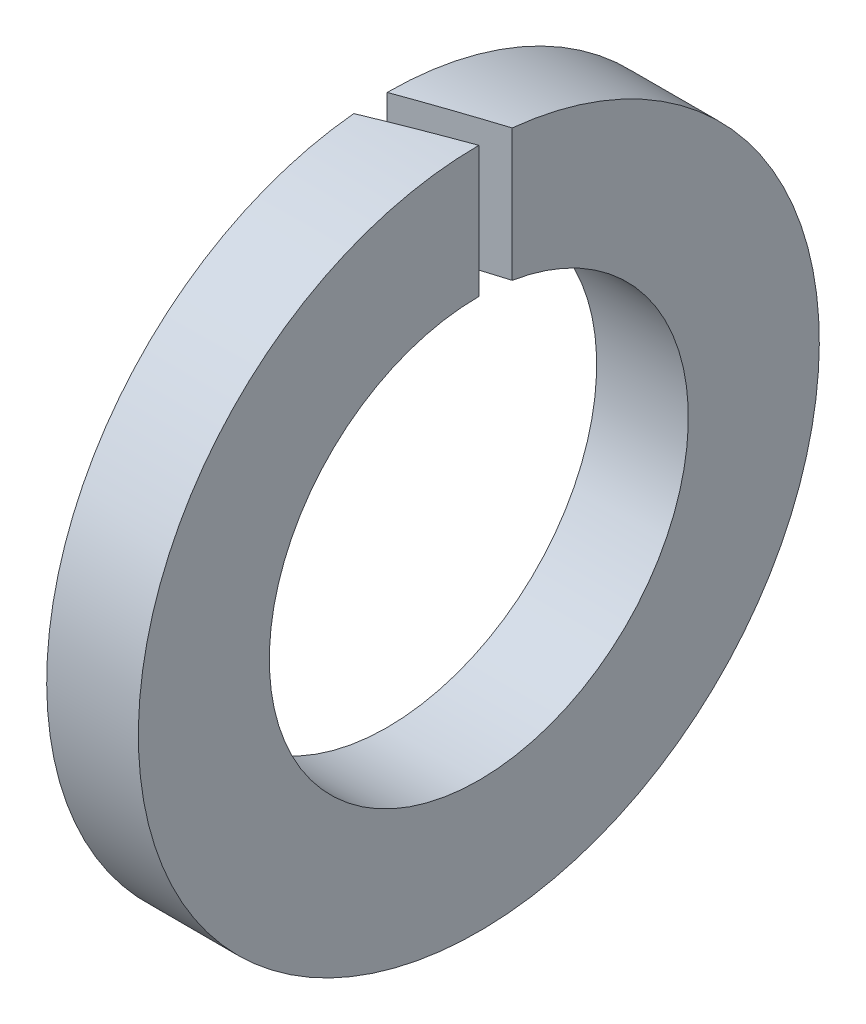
ISO-10303-21;
HEADER;
FILE_DESCRIPTION(('STEP AP214'),'2;1');
FILE_NAME('part.step','',(''),(''),'','','');
FILE_SCHEMA(('AUTOMOTIVE_DESIGN { 1 0 10303 214 1 1 1 1 }'));
ENDSEC;
DATA;
#1=APPLICATION_CONTEXT('core data for automotive mechanical design processes');
#2=APPLICATION_PROTOCOL_DEFINITION('international standard','automotive_design',2000,#1);
#3=PRODUCT_CONTEXT('',#1,'mechanical');
#4=PRODUCT('Part','Part','',(#3));
#5=PRODUCT_RELATED_PRODUCT_CATEGORY('part','',(#4));
#6=PRODUCT_DEFINITION_FORMATION('','',#4);
#7=PRODUCT_DEFINITION_CONTEXT('part definition',#1,'design');
#8=PRODUCT_DEFINITION('design','',#6,#7);
#9=PRODUCT_DEFINITION_SHAPE('','',#8);
#10=(LENGTH_UNIT() NAMED_UNIT(*) SI_UNIT(.MILLI.,.METRE.));
#11=(NAMED_UNIT(*) PLANE_ANGLE_UNIT() SI_UNIT($,.RADIAN.));
#12=(NAMED_UNIT(*) SI_UNIT($,.STERADIAN.) SOLID_ANGLE_UNIT());
#13=UNCERTAINTY_MEASURE_WITH_UNIT(LENGTH_MEASURE(1.E-05),#10,'distance_accuracy_value','');
#14=(GEOMETRIC_REPRESENTATION_CONTEXT(3) GLOBAL_UNCERTAINTY_ASSIGNED_CONTEXT((#13)) GLOBAL_UNIT_ASSIGNED_CONTEXT((#10,
#11,#12)) REPRESENTATION_CONTEXT('',''));
#15=CARTESIAN_POINT('',(0.,0.,0.));
#16=DIRECTION('',(0.,0.,1.));
#17=DIRECTION('',(1.,0.,0.));
#18=AXIS2_PLACEMENT_3D('',#15,#16,#17);
#19=CARTESIAN_POINT('',(0.,0.,-5.2));
#20=DIRECTION('',(1.,0.,0.));
#21=DIRECTION('',(0.,0.,-0.999999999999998));
#22=AXIS2_PLACEMENT_3D('',#19,#20,#21);
#23=PLANE('',#22);
#24=DIRECTION('',(0.,-0.999999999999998,0.));
#25=VECTOR('',#24,1.);
#26=CARTESIAN_POINT('',(0.,5.2,0.509558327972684));
#27=LINE('',#26,#25);
#28=CARTESIAN_POINT('',(0.,5.17497345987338,0.509558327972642));
#29=VERTEX_POINT('',#28);
#30=CARTESIAN_POINT('',(0.,3.1591692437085,0.509558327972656));
#31=VERTEX_POINT('',#30);
#32=EDGE_CURVE('E48',#29,#31,#27,.T.);
#33=ORIENTED_EDGE('',*,*,#32,.T.);
#34=CARTESIAN_POINT('',(0.,0.,0.));
#35=DIRECTION('',(-1.,0.,0.));
#36=DIRECTION('',(0.,0.,0.999999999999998));
#37=AXIS2_PLACEMENT_3D('',#34,#35,#36);
#38=CIRCLE('',#37,3.2);
#39=CARTESIAN_POINT('',(0.,3.19999999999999,0.));
#40=VERTEX_POINT('',#39);
#41=EDGE_CURVE('E82',#40,#31,#38,.T.);
#42=ORIENTED_EDGE('',*,*,#41,.F.);
#43=DIRECTION('',(0.,-0.999999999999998,0.));
#44=VECTOR('',#43,1.);
#45=CARTESIAN_POINT('',(0.,5.2,0.));
#46=LINE('',#45,#44);
#47=CARTESIAN_POINT('',(0.,5.2,0.));
#48=VERTEX_POINT('',#47);
#49=EDGE_CURVE('E91',#48,#40,#46,.T.);
#50=ORIENTED_EDGE('',*,*,#49,.F.);
#51=CARTESIAN_POINT('',(0.,0.,0.));
#52=DIRECTION('',(-1.,0.,0.));
#53=DIRECTION('',(0.,0.,0.999999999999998));
#54=AXIS2_PLACEMENT_3D('',#51,#52,#53);
#55=CIRCLE('',#54,5.2);
#56=EDGE_CURVE('E80',#48,#29,#55,.T.);
#57=ORIENTED_EDGE('',*,*,#56,.T.);
#58=EDGE_LOOP('',(#33,#42,#50,#57));
#59=FACE_BOUND('',#58,.T.);
#60=ADVANCED_FACE('F27',(#59),#23,.F.);
#61=CARTESIAN_POINT('',(0.,0.,0.));
#62=DIRECTION('',(-1.,0.,0.));
#63=DIRECTION('',(0.,0.,0.999999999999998));
#64=AXIS2_PLACEMENT_3D('',#61,#62,#63);
#65=CYLINDRICAL_SURFACE('',#64,3.2);
#66=CARTESIAN_POINT('',(1.4,0.,0.));
#67=DIRECTION('',(-0.34202014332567,0.,-0.939692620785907));
#68=DIRECTION('',(-0.939692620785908,0.,0.34202014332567));
#69=AXIS2_PLACEMENT_3D('',#66,#67,#68);
#70=ELLIPSE('',#69,9.35617408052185,3.2);
#71=CARTESIAN_POINT('',(1.4,3.19999999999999,0.));
#72=VERTEX_POINT('',#71);
#73=EDGE_CURVE('E84',#72,#31,#70,.F.);
#74=ORIENTED_EDGE('',*,*,#73,.F.);
#75=CARTESIAN_POINT('',(1.4,0.,0.));
#76=DIRECTION('',(-1.,0.,0.));
#77=DIRECTION('',(0.,0.,0.999999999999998));
#78=AXIS2_PLACEMENT_3D('',#75,#76,#77);
#79=CIRCLE('',#78,3.2);
#80=CARTESIAN_POINT('',(1.4,3.1591692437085,-0.509558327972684));
#81=VERTEX_POINT('',#80);
#82=EDGE_CURVE('E77',#81,#72,#79,.T.);
#83=ORIENTED_EDGE('',*,*,#82,.F.);
#84=CARTESIAN_POINT('',(0.,0.,0.));
#85=DIRECTION('',(0.34202014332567,0.,0.939692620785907));
#86=DIRECTION('',(-0.939692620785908,0.,0.34202014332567));
#87=AXIS2_PLACEMENT_3D('',#84,#85,#86);
#88=ELLIPSE('',#87,9.35617408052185,3.2);
#89=EDGE_CURVE('E99',#40,#81,#88,.F.);
#90=ORIENTED_EDGE('',*,*,#89,.F.);
#91=ORIENTED_EDGE('',*,*,#41,.T.);
#92=EDGE_LOOP('',(#74,#83,#90,#91));
#93=FACE_BOUND('',#92,.T.);
#94=ADVANCED_FACE('F101',(#93),#65,.F.);
#95=CARTESIAN_POINT('',(1.4,0.,-5.2));
#96=DIRECTION('',(-1.,0.,0.));
#97=DIRECTION('',(0.,0.,0.999999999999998));
#98=AXIS2_PLACEMENT_3D('',#95,#96,#97);
#99=PLANE('',#98);
#100=DIRECTION('',(0.,-0.999999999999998,0.));
#101=VECTOR('',#100,1.);
#102=CARTESIAN_POINT('',(1.4,5.2,0.));
#103=LINE('',#102,#101);
#104=CARTESIAN_POINT('',(1.4,5.2,0.));
#105=VERTEX_POINT('',#104);
#106=EDGE_CURVE('E65',#105,#72,#103,.T.);
#107=ORIENTED_EDGE('',*,*,#106,.F.);
#108=CARTESIAN_POINT('',(1.4,0.,0.));
#109=DIRECTION('',(-1.,0.,0.));
#110=DIRECTION('',(0.,0.,0.999999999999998));
#111=AXIS2_PLACEMENT_3D('',#108,#109,#110);
#112=CIRCLE('',#111,5.2);
#113=CARTESIAN_POINT('',(1.4,5.17497345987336,-0.509558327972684));
#114=VERTEX_POINT('',#113);
#115=EDGE_CURVE('E75',#114,#105,#112,.T.);
#116=ORIENTED_EDGE('',*,*,#115,.F.);
#117=DIRECTION('',(0.,-0.999999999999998,0.));
#118=VECTOR('',#117,1.);
#119=CARTESIAN_POINT('',(1.4,5.2,-0.509558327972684));
#120=LINE('',#119,#118);
#121=EDGE_CURVE('E41',#114,#81,#120,.T.);
#122=ORIENTED_EDGE('',*,*,#121,.T.);
#123=ORIENTED_EDGE('',*,*,#82,.T.);
#124=EDGE_LOOP('',(#107,#116,#122,#123));
#125=FACE_BOUND('',#124,.T.);
#126=ADVANCED_FACE('F74',(#125),#99,.F.);
#127=CARTESIAN_POINT('',(0.,0.,0.));
#128=DIRECTION('',(-1.,0.,0.));
#129=DIRECTION('',(0.,0.,0.999999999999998));
#130=AXIS2_PLACEMENT_3D('',#127,#128,#129);
#131=CYLINDRICAL_SURFACE('',#130,5.2);
#132=CARTESIAN_POINT('',(1.4,0.,0.));
#133=DIRECTION('',(-0.34202014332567,0.,-0.939692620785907));
#134=DIRECTION('',(-0.939692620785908,0.,0.34202014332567));
#135=AXIS2_PLACEMENT_3D('',#132,#133,#134);
#136=ELLIPSE('',#135,15.203782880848,5.2);
#137=EDGE_CURVE('E11',#29,#105,#136,.T.);
#138=ORIENTED_EDGE('',*,*,#137,.F.);
#139=ORIENTED_EDGE('',*,*,#56,.F.);
#140=CARTESIAN_POINT('',(0.,0.,0.));
#141=DIRECTION('',(0.34202014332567,0.,0.939692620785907));
#142=DIRECTION('',(-0.939692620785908,0.,0.34202014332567));
#143=AXIS2_PLACEMENT_3D('',#140,#141,#142);
#144=ELLIPSE('',#143,15.203782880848,5.2);
#145=EDGE_CURVE('E34',#114,#48,#144,.T.);
#146=ORIENTED_EDGE('',*,*,#145,.F.);
#147=ORIENTED_EDGE('',*,*,#115,.T.);
#148=EDGE_LOOP('',(#138,#139,#146,#147));
#149=FACE_BOUND('',#148,.T.);
#150=ADVANCED_FACE('F79',(#149),#131,.T.);
#151=CARTESIAN_POINT('',(0.,5.2,0.));
#152=DIRECTION('',(0.34202014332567,0.,0.939692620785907));
#153=DIRECTION('',(0.939692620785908,0.,-0.34202014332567));
#154=AXIS2_PLACEMENT_3D('',#151,#152,#153);
#155=PLANE('',#154);
#156=ORIENTED_EDGE('',*,*,#89,.T.);
#157=ORIENTED_EDGE('',*,*,#121,.F.);
#158=ORIENTED_EDGE('',*,*,#145,.T.);
#159=ORIENTED_EDGE('',*,*,#49,.T.);
#160=EDGE_LOOP('',(#156,#157,#158,#159));
#161=FACE_BOUND('',#160,.T.);
#162=ADVANCED_FACE('F90',(#161),#155,.T.);
#163=CARTESIAN_POINT('',(1.4,5.2,0.));
#164=DIRECTION('',(-0.34202014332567,0.,-0.939692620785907));
#165=DIRECTION('',(-0.939692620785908,0.,0.34202014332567));
#166=AXIS2_PLACEMENT_3D('',#163,#164,#165);
#167=PLANE('',#166);
#168=ORIENTED_EDGE('',*,*,#73,.T.);
#169=ORIENTED_EDGE('',*,*,#32,.F.);
#170=ORIENTED_EDGE('',*,*,#137,.T.);
#171=ORIENTED_EDGE('',*,*,#106,.T.);
#172=EDGE_LOOP('',(#168,#169,#170,#171));
#173=FACE_BOUND('',#172,.T.);
#174=ADVANCED_FACE('F64',(#173),#167,.T.);
#175=CLOSED_SHELL('',(#60,#94,#126,#150,#162,#174));
#176=MANIFOLD_SOLID_BREP('B2',#175);
#177=ADVANCED_BREP_SHAPE_REPRESENTATION('',(#18,#176),#14);
#178=SHAPE_DEFINITION_REPRESENTATION(#9,#177);
ENDSEC;
END-ISO-10303-21;
